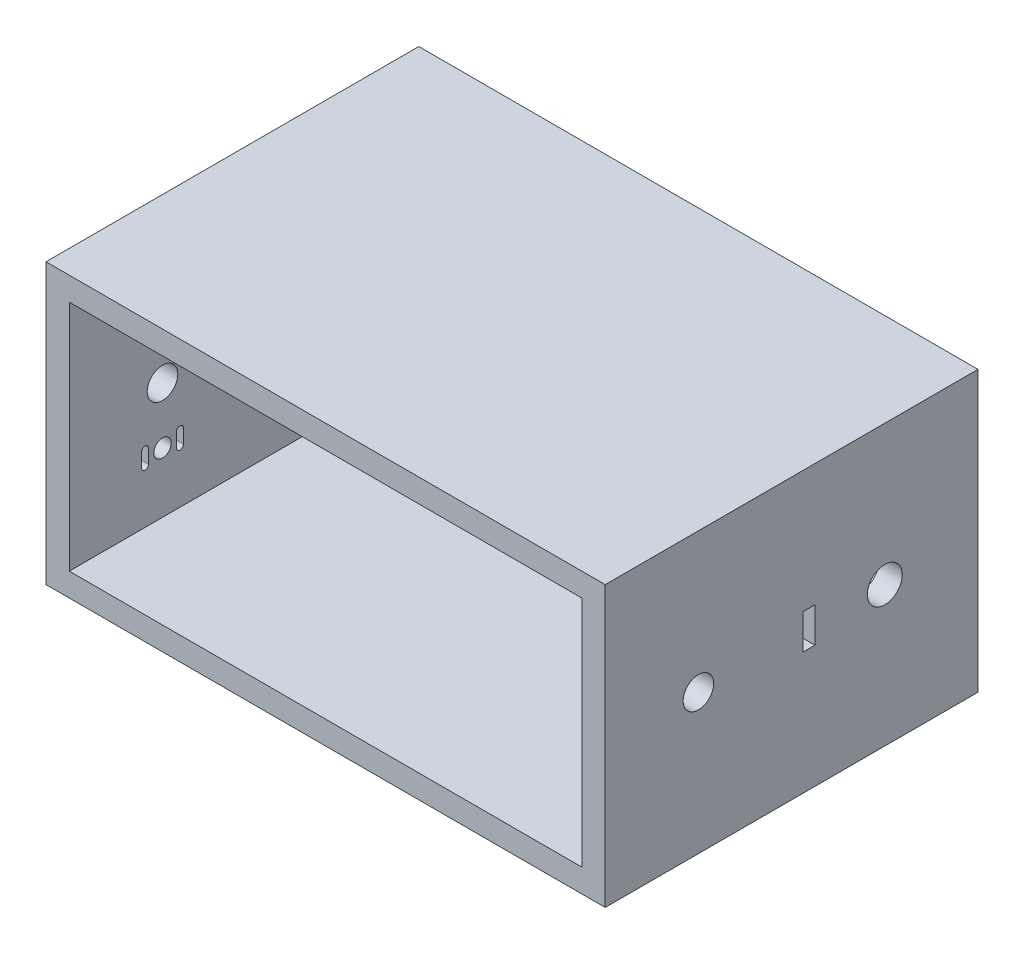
ISO-10303-21;
HEADER;
FILE_DESCRIPTION(('STEP AP214'),'2;1');
FILE_NAME('part.step','',(''),(''),'','','');
FILE_SCHEMA(('AUTOMOTIVE_DESIGN { 1 0 10303 214 1 1 1 1 }'));
ENDSEC;
DATA;
#1=APPLICATION_CONTEXT('core data for automotive mechanical design processes');
#2=APPLICATION_PROTOCOL_DEFINITION('international standard','automotive_design',2000,#1);
#3=PRODUCT_CONTEXT('',#1,'mechanical');
#4=PRODUCT('Part','Part','',(#3));
#5=PRODUCT_RELATED_PRODUCT_CATEGORY('part','',(#4));
#6=PRODUCT_DEFINITION_FORMATION('','',#4);
#7=PRODUCT_DEFINITION_CONTEXT('part definition',#1,'design');
#8=PRODUCT_DEFINITION('design','',#6,#7);
#9=PRODUCT_DEFINITION_SHAPE('','',#8);
#10=(LENGTH_UNIT() NAMED_UNIT(*) SI_UNIT(.MILLI.,.METRE.));
#11=(NAMED_UNIT(*) PLANE_ANGLE_UNIT() SI_UNIT($,.RADIAN.));
#12=(NAMED_UNIT(*) SI_UNIT($,.STERADIAN.) SOLID_ANGLE_UNIT());
#13=UNCERTAINTY_MEASURE_WITH_UNIT(LENGTH_MEASURE(1.E-05),#10,'distance_accuracy_value','');
#14=(GEOMETRIC_REPRESENTATION_CONTEXT(3) GLOBAL_UNCERTAINTY_ASSIGNED_CONTEXT((#13)) GLOBAL_UNIT_ASSIGNED_CONTEXT((#10,
#11,#12)) REPRESENTATION_CONTEXT('',''));
#15=CARTESIAN_POINT('',(0.,0.,0.));
#16=DIRECTION('',(0.,0.,1.));
#17=DIRECTION('',(1.,0.,0.));
#18=AXIS2_PLACEMENT_3D('',#15,#16,#17);
#19=CARTESIAN_POINT('',(-36.7081196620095,-26.4129533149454,203.2));
#20=DIRECTION('',(0.,0.,1.));
#21=DIRECTION('',(1.,0.,0.));
#22=AXIS2_PLACEMENT_3D('',#19,#20,#21);
#23=PLANE('',#22);
#24=DIRECTION('',(0.,-1.,0.));
#25=VECTOR('',#24,1.);
#26=CARTESIAN_POINT('',(-36.7081196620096,125.987046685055,203.2));
#27=LINE('',#26,#25);
#28=CARTESIAN_POINT('',(-36.7081196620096,125.987046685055,203.2));
#29=VERTEX_POINT('',#28);
#30=CARTESIAN_POINT('',(-36.7081196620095,-26.4129533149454,203.2));
#31=VERTEX_POINT('',#30);
#32=EDGE_CURVE('E362',#29,#31,#27,.T.);
#33=ORIENTED_EDGE('',*,*,#32,.T.);
#34=DIRECTION('',(1.,0.,0.));
#35=VECTOR('',#34,1.);
#36=CARTESIAN_POINT('',(-36.7081196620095,-26.4129533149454,203.2));
#37=LINE('',#36,#35);
#38=CARTESIAN_POINT('',(268.09188033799,-26.4129533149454,203.2));
#39=VERTEX_POINT('',#38);
#40=EDGE_CURVE('E365',#31,#39,#37,.T.);
#41=ORIENTED_EDGE('',*,*,#40,.T.);
#42=DIRECTION('',(0.,1.,0.));
#43=VECTOR('',#42,1.);
#44=CARTESIAN_POINT('',(268.09188033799,125.987046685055,203.2));
#45=LINE('',#44,#43);
#46=CARTESIAN_POINT('',(268.09188033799,125.987046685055,203.2));
#47=VERTEX_POINT('',#46);
#48=EDGE_CURVE('E368',#39,#47,#45,.T.);
#49=ORIENTED_EDGE('',*,*,#48,.T.);
#50=DIRECTION('',(-1.,0.,0.));
#51=VECTOR('',#50,1.);
#52=CARTESIAN_POINT('',(-36.7081196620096,125.987046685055,203.2));
#53=LINE('',#52,#51);
#54=EDGE_CURVE('E370',#47,#29,#53,.T.);
#55=ORIENTED_EDGE('',*,*,#54,.T.);
#56=EDGE_LOOP('',(#33,#41,#49,#55));
#57=FACE_BOUND('',#56,.T.);
#58=DIRECTION('',(1.,0.,0.));
#59=VECTOR('',#58,1.);
#60=CARTESIAN_POINT('',(-24.0081196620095,-13.7129533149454,203.2));
#61=LINE('',#60,#59);
#62=CARTESIAN_POINT('',(-24.0081196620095,-13.7129533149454,203.2));
#63=VERTEX_POINT('',#62);
#64=CARTESIAN_POINT('',(255.39188033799,-13.7129533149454,203.2));
#65=VERTEX_POINT('',#64);
#66=EDGE_CURVE('E333',#63,#65,#61,.T.);
#67=ORIENTED_EDGE('',*,*,#66,.F.);
#68=DIRECTION('',(0.,-1.,0.));
#69=VECTOR('',#68,1.);
#70=CARTESIAN_POINT('',(-24.0081196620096,113.287046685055,203.2));
#71=LINE('',#70,#69);
#72=CARTESIAN_POINT('',(-24.0081196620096,113.287046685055,203.2));
#73=VERTEX_POINT('',#72);
#74=EDGE_CURVE('E331',#73,#63,#71,.T.);
#75=ORIENTED_EDGE('',*,*,#74,.F.);
#76=DIRECTION('',(-1.,0.,0.));
#77=VECTOR('',#76,1.);
#78=CARTESIAN_POINT('',(-24.0081196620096,113.287046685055,203.2));
#79=LINE('',#78,#77);
#80=CARTESIAN_POINT('',(255.39188033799,113.287046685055,203.2));
#81=VERTEX_POINT('',#80);
#82=EDGE_CURVE('E339',#81,#73,#79,.T.);
#83=ORIENTED_EDGE('',*,*,#82,.F.);
#84=DIRECTION('',(0.,1.,0.));
#85=VECTOR('',#84,1.);
#86=CARTESIAN_POINT('',(255.39188033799,113.287046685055,203.2));
#87=LINE('',#86,#85);
#88=EDGE_CURVE('E336',#65,#81,#87,.T.);
#89=ORIENTED_EDGE('',*,*,#88,.F.);
#90=EDGE_LOOP('',(#67,#75,#83,#89));
#91=FACE_BOUND('',#90,.T.);
#92=ADVANCED_FACE('F30',(#57,#91),#23,.T.);
#93=CARTESIAN_POINT('',(-36.7081196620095,-26.4129533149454,0.));
#94=DIRECTION('',(0.,0.,1.));
#95=DIRECTION('',(1.,0.,0.));
#96=AXIS2_PLACEMENT_3D('',#93,#94,#95);
#97=PLANE('',#96);
#98=DIRECTION('',(0.,-1.,0.));
#99=VECTOR('',#98,1.);
#100=CARTESIAN_POINT('',(-36.7081196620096,125.987046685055,0.));
#101=LINE('',#100,#99);
#102=CARTESIAN_POINT('',(-36.7081196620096,125.987046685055,0.));
#103=VERTEX_POINT('',#102);
#104=CARTESIAN_POINT('',(-36.7081196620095,-26.4129533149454,0.));
#105=VERTEX_POINT('',#104);
#106=EDGE_CURVE('E361',#103,#105,#101,.T.);
#107=ORIENTED_EDGE('',*,*,#106,.F.);
#108=DIRECTION('',(-1.,0.,0.));
#109=VECTOR('',#108,1.);
#110=CARTESIAN_POINT('',(-36.7081196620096,125.987046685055,0.));
#111=LINE('',#110,#109);
#112=CARTESIAN_POINT('',(268.09188033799,125.987046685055,0.));
#113=VERTEX_POINT('',#112);
#114=EDGE_CURVE('E366',#113,#103,#111,.T.);
#115=ORIENTED_EDGE('',*,*,#114,.F.);
#116=DIRECTION('',(0.,1.,0.));
#117=VECTOR('',#116,1.);
#118=CARTESIAN_POINT('',(268.09188033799,125.987046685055,0.));
#119=LINE('',#118,#117);
#120=CARTESIAN_POINT('',(268.09188033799,-26.4129533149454,0.));
#121=VERTEX_POINT('',#120);
#122=EDGE_CURVE('E377',#121,#113,#119,.T.);
#123=ORIENTED_EDGE('',*,*,#122,.F.);
#124=DIRECTION('',(1.,0.,0.));
#125=VECTOR('',#124,1.);
#126=CARTESIAN_POINT('',(-36.7081196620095,-26.4129533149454,0.));
#127=LINE('',#126,#125);
#128=EDGE_CURVE('E375',#105,#121,#127,.T.);
#129=ORIENTED_EDGE('',*,*,#128,.F.);
#130=EDGE_LOOP('',(#107,#115,#123,#129));
#131=FACE_BOUND('',#130,.T.);
#132=DIRECTION('',(0.,-1.,0.));
#133=VECTOR('',#132,1.);
#134=CARTESIAN_POINT('',(-24.0081196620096,113.287046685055,0.));
#135=LINE('',#134,#133);
#136=CARTESIAN_POINT('',(-24.0081196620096,113.287046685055,0.));
#137=VERTEX_POINT('',#136);
#138=CARTESIAN_POINT('',(-24.0081196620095,-13.7129533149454,0.));
#139=VERTEX_POINT('',#138);
#140=EDGE_CURVE('E330',#137,#139,#135,.T.);
#141=ORIENTED_EDGE('',*,*,#140,.T.);
#142=DIRECTION('',(1.,0.,0.));
#143=VECTOR('',#142,1.);
#144=CARTESIAN_POINT('',(-24.0081196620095,-13.7129533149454,0.));
#145=LINE('',#144,#143);
#146=CARTESIAN_POINT('',(255.39188033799,-13.7129533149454,0.));
#147=VERTEX_POINT('',#146);
#148=EDGE_CURVE('E344',#139,#147,#145,.T.);
#149=ORIENTED_EDGE('',*,*,#148,.T.);
#150=DIRECTION('',(0.,1.,0.));
#151=VECTOR('',#150,1.);
#152=CARTESIAN_POINT('',(255.39188033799,113.287046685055,0.));
#153=LINE('',#152,#151);
#154=CARTESIAN_POINT('',(255.39188033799,113.287046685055,0.));
#155=VERTEX_POINT('',#154);
#156=EDGE_CURVE('E347',#147,#155,#153,.T.);
#157=ORIENTED_EDGE('',*,*,#156,.T.);
#158=DIRECTION('',(-1.,0.,0.));
#159=VECTOR('',#158,1.);
#160=CARTESIAN_POINT('',(-24.0081196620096,113.287046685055,0.));
#161=LINE('',#160,#159);
#162=EDGE_CURVE('E334',#155,#137,#161,.T.);
#163=ORIENTED_EDGE('',*,*,#162,.T.);
#164=EDGE_LOOP('',(#141,#149,#157,#163));
#165=FACE_BOUND('',#164,.T.);
#166=ADVANCED_FACE('F420',(#131,#165),#97,.F.);
#167=CARTESIAN_POINT('',(-36.7081196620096,125.987046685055,203.2));
#168=DIRECTION('',(1.,0.,0.));
#169=DIRECTION('',(0.,1.,0.));
#170=AXIS2_PLACEMENT_3D('',#167,#168,#169);
#171=PLANE('',#170);
#172=CARTESIAN_POINT('',(-36.7081196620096,49.7870466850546,50.8));
#173=DIRECTION('',(-1.,0.,0.));
#174=DIRECTION('',(0.,0.,1.));
#175=AXIS2_PLACEMENT_3D('',#172,#173,#174);
#176=CIRCLE('',#175,9.52499999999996);
#177=CARTESIAN_POINT('',(-36.7081196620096,49.7870466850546,60.325));
#178=VERTEX_POINT('',#177);
#179=EDGE_CURVE('E564',#178,#178,#176,.T.);
#180=ORIENTED_EDGE('',*,*,#179,.F.);
#181=EDGE_LOOP('',(#180));
#182=FACE_BOUND('',#181,.T.);
#183=DIRECTION('',(0.,0.,1.));
#184=VECTOR('',#183,1.);
#185=CARTESIAN_POINT('',(-36.7081196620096,40.2620466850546,88.9));
#186=LINE('',#185,#184);
#187=CARTESIAN_POINT('',(-36.7081196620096,40.2620466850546,88.9));
#188=VERTEX_POINT('',#187);
#189=CARTESIAN_POINT('',(-36.7081196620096,40.2620466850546,95.25));
#190=VERTEX_POINT('',#189);
#191=EDGE_CURVE('E228',#188,#190,#186,.T.);
#192=ORIENTED_EDGE('',*,*,#191,.F.);
#193=DIRECTION('',(0.,-1.,0.));
#194=VECTOR('',#193,1.);
#195=CARTESIAN_POINT('',(-36.7081196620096,40.2620466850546,88.9));
#196=LINE('',#195,#194);
#197=CARTESIAN_POINT('',(-36.7081196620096,59.3120466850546,88.9));
#198=VERTEX_POINT('',#197);
#199=EDGE_CURVE('E46',#198,#188,#196,.T.);
#200=ORIENTED_EDGE('',*,*,#199,.F.);
#201=DIRECTION('',(0.,0.,-1.));
#202=VECTOR('',#201,1.);
#203=CARTESIAN_POINT('',(-36.7081196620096,59.3120466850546,88.9));
#204=LINE('',#203,#202);
#205=CARTESIAN_POINT('',(-36.7081196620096,59.3120466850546,95.25));
#206=VERTEX_POINT('',#205);
#207=EDGE_CURVE('E216',#206,#198,#204,.T.);
#208=ORIENTED_EDGE('',*,*,#207,.F.);
#209=DIRECTION('',(0.,1.,0.));
#210=VECTOR('',#209,1.);
#211=CARTESIAN_POINT('',(-36.7081196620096,40.2620466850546,95.25));
#212=LINE('',#211,#210);
#213=EDGE_CURVE('E219',#190,#206,#212,.T.);
#214=ORIENTED_EDGE('',*,*,#213,.F.);
#215=EDGE_LOOP('',(#192,#200,#208,#214));
#216=FACE_BOUND('',#215,.T.);
#217=DIRECTION('',(0.,-1.,0.));
#218=VECTOR('',#217,1.);
#219=CARTESIAN_POINT('',(-36.7081196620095,22.86,160.02));
#220=LINE('',#219,#218);
#221=CARTESIAN_POINT('',(-36.7081196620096,22.86,160.02));
#222=VERTEX_POINT('',#221);
#223=CARTESIAN_POINT('',(-36.7081196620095,15.24,160.02));
#224=VERTEX_POINT('',#223);
#225=EDGE_CURVE('E263',#222,#224,#220,.T.);
#226=ORIENTED_EDGE('',*,*,#225,.F.);
#227=CARTESIAN_POINT('',(-36.7081196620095,22.86,161.925));
#228=DIRECTION('',(-1.,0.,0.));
#229=DIRECTION('',(0.,1.,0.));
#230=AXIS2_PLACEMENT_3D('',#227,#228,#229);
#231=CIRCLE('',#230,1.90499999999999);
#232=CARTESIAN_POINT('',(-36.7081196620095,22.86,163.83));
#233=VERTEX_POINT('',#232);
#234=EDGE_CURVE('E266',#233,#222,#231,.T.);
#235=ORIENTED_EDGE('',*,*,#234,.F.);
#236=DIRECTION('',(0.,1.,0.));
#237=VECTOR('',#236,1.);
#238=CARTESIAN_POINT('',(-36.7081196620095,22.86,163.83));
#239=LINE('',#238,#237);
#240=CARTESIAN_POINT('',(-36.7081196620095,15.24,163.83));
#241=VERTEX_POINT('',#240);
#242=EDGE_CURVE('E256',#241,#233,#239,.T.);
#243=ORIENTED_EDGE('',*,*,#242,.F.);
#244=CARTESIAN_POINT('',(-36.7081196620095,15.24,161.925));
#245=DIRECTION('',(-1.,0.,0.));
#246=DIRECTION('',(0.,1.,0.));
#247=AXIS2_PLACEMENT_3D('',#244,#245,#246);
#248=CIRCLE('',#247,1.90499999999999);
#249=EDGE_CURVE('E260',#224,#241,#248,.T.);
#250=ORIENTED_EDGE('',*,*,#249,.F.);
#251=EDGE_LOOP('',(#226,#235,#243,#250));
#252=FACE_BOUND('',#251,.T.);
#253=DIRECTION('',(0.,-1.,0.));
#254=VECTOR('',#253,1.);
#255=CARTESIAN_POINT('',(-36.7081196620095,22.86,140.97));
#256=LINE('',#255,#254);
#257=CARTESIAN_POINT('',(-36.7081196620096,22.86,140.97));
#258=VERTEX_POINT('',#257);
#259=CARTESIAN_POINT('',(-36.7081196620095,15.24,140.97));
#260=VERTEX_POINT('',#259);
#261=EDGE_CURVE('E295',#258,#260,#256,.T.);
#262=ORIENTED_EDGE('',*,*,#261,.F.);
#263=CARTESIAN_POINT('',(-36.7081196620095,22.86,142.875));
#264=DIRECTION('',(-1.,0.,0.));
#265=DIRECTION('',(0.,-1.,0.));
#266=AXIS2_PLACEMENT_3D('',#263,#264,#265);
#267=CIRCLE('',#266,1.90499999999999);
#268=CARTESIAN_POINT('',(-36.7081196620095,22.86,144.78));
#269=VERTEX_POINT('',#268);
#270=EDGE_CURVE('E298',#269,#258,#267,.T.);
#271=ORIENTED_EDGE('',*,*,#270,.F.);
#272=DIRECTION('',(0.,1.,0.));
#273=VECTOR('',#272,1.);
#274=CARTESIAN_POINT('',(-36.7081196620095,22.86,144.78));
#275=LINE('',#274,#273);
#276=CARTESIAN_POINT('',(-36.7081196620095,15.24,144.78));
#277=VERTEX_POINT('',#276);
#278=EDGE_CURVE('E288',#277,#269,#275,.T.);
#279=ORIENTED_EDGE('',*,*,#278,.F.);
#280=CARTESIAN_POINT('',(-36.7081196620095,15.24,142.875));
#281=DIRECTION('',(-1.,0.,0.));
#282=DIRECTION('',(0.,-1.,0.));
#283=AXIS2_PLACEMENT_3D('',#280,#281,#282);
#284=CIRCLE('',#283,1.90499999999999);
#285=EDGE_CURVE('E292',#260,#277,#284,.T.);
#286=ORIENTED_EDGE('',*,*,#285,.F.);
#287=EDGE_LOOP('',(#262,#271,#279,#286));
#288=FACE_BOUND('',#287,.T.);
#289=CARTESIAN_POINT('',(-36.7081196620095,19.05,152.4));
#290=DIRECTION('',(-1.,0.,0.));
#291=DIRECTION('',(0.,-1.,0.));
#292=AXIS2_PLACEMENT_3D('',#289,#290,#291);
#293=CIRCLE('',#292,4.76250000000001);
#294=CARTESIAN_POINT('',(-36.7081196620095,14.2875,152.4));
#295=VERTEX_POINT('',#294);
#296=EDGE_CURVE('E317',#295,#295,#293,.T.);
#297=ORIENTED_EDGE('',*,*,#296,.F.);
#298=EDGE_LOOP('',(#297));
#299=FACE_BOUND('',#298,.T.);
#300=CARTESIAN_POINT('',(-36.7081196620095,49.7870466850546,152.4));
#301=DIRECTION('',(1.,0.,0.));
#302=DIRECTION('',(0.,0.,-1.));
#303=AXIS2_PLACEMENT_3D('',#300,#301,#302);
#304=CIRCLE('',#303,8.33373999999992);
#305=CARTESIAN_POINT('',(-36.7081196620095,49.7870466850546,144.06626));
#306=VERTEX_POINT('',#305);
#307=EDGE_CURVE('E323',#306,#306,#304,.T.);
#308=ORIENTED_EDGE('',*,*,#307,.T.);
#309=EDGE_LOOP('',(#308));
#310=FACE_BOUND('',#309,.T.);
#311=ORIENTED_EDGE('',*,*,#106,.T.);
#312=DIRECTION('',(0.,0.,-1.));
#313=VECTOR('',#312,1.);
#314=CARTESIAN_POINT('',(-36.7081196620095,-26.4129533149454,203.2));
#315=LINE('',#314,#313);
#316=EDGE_CURVE('E388',#31,#105,#315,.T.);
#317=ORIENTED_EDGE('',*,*,#316,.F.);
#318=ORIENTED_EDGE('',*,*,#32,.F.);
#319=DIRECTION('',(0.,0.,-1.));
#320=VECTOR('',#319,1.);
#321=CARTESIAN_POINT('',(-36.7081196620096,125.987046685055,203.2));
#322=LINE('',#321,#320);
#323=EDGE_CURVE('E372',#29,#103,#322,.T.);
#324=ORIENTED_EDGE('',*,*,#323,.T.);
#325=EDGE_LOOP('',(#311,#317,#318,#324));
#326=FACE_BOUND('',#325,.T.);
#327=ADVANCED_FACE('F32',(#182,#216,#252,#288,#299,#310,#326),#171,.F.);
#328=CARTESIAN_POINT('',(-36.7081196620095,-26.4129533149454,203.2));
#329=DIRECTION('',(0.,1.,0.));
#330=DIRECTION('',(-1.,0.,0.));
#331=AXIS2_PLACEMENT_3D('',#328,#329,#330);
#332=PLANE('',#331);
#333=ORIENTED_EDGE('',*,*,#128,.T.);
#334=DIRECTION('',(0.,0.,-1.));
#335=VECTOR('',#334,1.);
#336=CARTESIAN_POINT('',(268.09188033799,-26.4129533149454,203.2));
#337=LINE('',#336,#335);
#338=EDGE_CURVE('E385',#39,#121,#337,.T.);
#339=ORIENTED_EDGE('',*,*,#338,.F.);
#340=ORIENTED_EDGE('',*,*,#40,.F.);
#341=ORIENTED_EDGE('',*,*,#316,.T.);
#342=EDGE_LOOP('',(#333,#339,#340,#341));
#343=FACE_BOUND('',#342,.T.);
#344=ADVANCED_FACE('F438',(#343),#332,.F.);
#345=CARTESIAN_POINT('',(268.09188033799,125.987046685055,203.2));
#346=DIRECTION('',(-1.,0.,0.));
#347=DIRECTION('',(0.,0.,1.));
#348=AXIS2_PLACEMENT_3D('',#345,#346,#347);
#349=PLANE('',#348);
#350=CARTESIAN_POINT('',(268.09188033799,49.7870466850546,50.8));
#351=DIRECTION('',(-1.,0.,0.));
#352=DIRECTION('',(0.,0.,1.));
#353=AXIS2_PLACEMENT_3D('',#350,#351,#352);
#354=CIRCLE('',#353,9.52499999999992);
#355=CARTESIAN_POINT('',(268.09188033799,49.7870466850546,60.3249999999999));
#356=VERTEX_POINT('',#355);
#357=EDGE_CURVE('E563',#356,#356,#354,.T.);
#358=ORIENTED_EDGE('',*,*,#357,.T.);
#359=EDGE_LOOP('',(#358));
#360=FACE_BOUND('',#359,.T.);
#361=DIRECTION('',(0.,0.,-1.));
#362=VECTOR('',#361,1.);
#363=CARTESIAN_POINT('',(268.09188033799,59.3120466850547,88.9));
#364=LINE('',#363,#362);
#365=CARTESIAN_POINT('',(268.09188033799,59.3120466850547,95.25));
#366=VERTEX_POINT('',#365);
#367=CARTESIAN_POINT('',(268.09188033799,59.3120466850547,88.9));
#368=VERTEX_POINT('',#367);
#369=EDGE_CURVE('E215',#366,#368,#364,.T.);
#370=ORIENTED_EDGE('',*,*,#369,.T.);
#371=DIRECTION('',(0.,-1.,0.));
#372=VECTOR('',#371,1.);
#373=CARTESIAN_POINT('',(268.09188033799,40.2620466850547,88.9));
#374=LINE('',#373,#372);
#375=CARTESIAN_POINT('',(268.09188033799,40.2620466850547,88.9));
#376=VERTEX_POINT('',#375);
#377=EDGE_CURVE('E198',#368,#376,#374,.T.);
#378=ORIENTED_EDGE('',*,*,#377,.T.);
#379=DIRECTION('',(0.,0.,1.));
#380=VECTOR('',#379,1.);
#381=CARTESIAN_POINT('',(268.09188033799,40.2620466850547,88.9));
#382=LINE('',#381,#380);
#383=CARTESIAN_POINT('',(268.09188033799,40.2620466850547,95.25));
#384=VERTEX_POINT('',#383);
#385=EDGE_CURVE('E207',#376,#384,#382,.T.);
#386=ORIENTED_EDGE('',*,*,#385,.T.);
#387=DIRECTION('',(0.,1.,0.));
#388=VECTOR('',#387,1.);
#389=CARTESIAN_POINT('',(268.09188033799,40.2620466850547,95.25));
#390=LINE('',#389,#388);
#391=EDGE_CURVE('E54',#384,#366,#390,.T.);
#392=ORIENTED_EDGE('',*,*,#391,.T.);
#393=EDGE_LOOP('',(#370,#378,#386,#392));
#394=FACE_BOUND('',#393,.T.);
#395=CARTESIAN_POINT('',(268.09188033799,49.7870466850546,152.4));
#396=DIRECTION('',(1.,0.,0.));
#397=DIRECTION('',(0.,0.,-1.));
#398=AXIS2_PLACEMENT_3D('',#395,#396,#397);
#399=CIRCLE('',#398,8.33373999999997);
#400=CARTESIAN_POINT('',(268.09188033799,49.7870466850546,144.06626));
#401=VERTEX_POINT('',#400);
#402=EDGE_CURVE('E320',#401,#401,#399,.T.);
#403=ORIENTED_EDGE('',*,*,#402,.F.);
#404=EDGE_LOOP('',(#403));
#405=FACE_BOUND('',#404,.T.);
#406=ORIENTED_EDGE('',*,*,#122,.T.);
#407=DIRECTION('',(0.,0.,-1.));
#408=VECTOR('',#407,1.);
#409=CARTESIAN_POINT('',(268.09188033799,125.987046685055,203.2));
#410=LINE('',#409,#408);
#411=EDGE_CURVE('E382',#47,#113,#410,.T.);
#412=ORIENTED_EDGE('',*,*,#411,.F.);
#413=ORIENTED_EDGE('',*,*,#48,.F.);
#414=ORIENTED_EDGE('',*,*,#338,.T.);
#415=EDGE_LOOP('',(#406,#412,#413,#414));
#416=FACE_BOUND('',#415,.T.);
#417=ADVANCED_FACE('F212',(#360,#394,#405,#416),#349,.F.);
#418=CARTESIAN_POINT('',(-36.7081196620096,125.987046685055,203.2));
#419=DIRECTION('',(0.,-1.,0.));
#420=DIRECTION('',(0.,0.,-1.));
#421=AXIS2_PLACEMENT_3D('',#418,#419,#420);
#422=PLANE('',#421);
#423=ORIENTED_EDGE('',*,*,#114,.T.);
#424=ORIENTED_EDGE('',*,*,#323,.F.);
#425=ORIENTED_EDGE('',*,*,#54,.F.);
#426=ORIENTED_EDGE('',*,*,#411,.T.);
#427=EDGE_LOOP('',(#423,#424,#425,#426));
#428=FACE_BOUND('',#427,.T.);
#429=ADVANCED_FACE('F433',(#428),#422,.F.);
#430=CARTESIAN_POINT('',(-24.0081196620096,113.287046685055,203.2));
#431=DIRECTION('',(1.,0.,0.));
#432=DIRECTION('',(0.,1.,0.));
#433=AXIS2_PLACEMENT_3D('',#430,#431,#432);
#434=PLANE('',#433);
#435=CARTESIAN_POINT('',(-24.0081196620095,49.7870466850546,50.8));
#436=DIRECTION('',(1.,0.,0.));
#437=DIRECTION('',(0.,1.,0.));
#438=AXIS2_PLACEMENT_3D('',#435,#436,#437);
#439=CIRCLE('',#438,9.52499999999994);
#440=CARTESIAN_POINT('',(-24.0081196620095,59.3120466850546,50.8));
#441=VERTEX_POINT('',#440);
#442=EDGE_CURVE('E222',#441,#441,#439,.T.);
#443=ORIENTED_EDGE('',*,*,#442,.F.);
#444=EDGE_LOOP('',(#443));
#445=FACE_BOUND('',#444,.T.);
#446=DIRECTION('',(0.,1.,0.));
#447=VECTOR('',#446,1.);
#448=CARTESIAN_POINT('',(-24.0081196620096,113.287046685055,88.9));
#449=LINE('',#448,#447);
#450=CARTESIAN_POINT('',(-24.0081196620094,40.2620466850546,88.9));
#451=VERTEX_POINT('',#450);
#452=CARTESIAN_POINT('',(-24.0081196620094,59.3120466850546,88.9));
#453=VERTEX_POINT('',#452);
#454=EDGE_CURVE('E248',#451,#453,#449,.T.);
#455=ORIENTED_EDGE('',*,*,#454,.F.);
#456=DIRECTION('',(0.,0.,-1.));
#457=VECTOR('',#456,1.);
#458=CARTESIAN_POINT('',(-24.0081196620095,40.2620466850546,203.2));
#459=LINE('',#458,#457);
#460=CARTESIAN_POINT('',(-24.0081196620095,40.2620466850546,95.25));
#461=VERTEX_POINT('',#460);
#462=EDGE_CURVE('E235',#461,#451,#459,.T.);
#463=ORIENTED_EDGE('',*,*,#462,.F.);
#464=DIRECTION('',(0.,-1.,0.));
#465=VECTOR('',#464,1.);
#466=CARTESIAN_POINT('',(-24.0081196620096,113.287046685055,95.25));
#467=LINE('',#466,#465);
#468=CARTESIAN_POINT('',(-24.0081196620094,59.3120466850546,95.25));
#469=VERTEX_POINT('',#468);
#470=EDGE_CURVE('E243',#469,#461,#467,.T.);
#471=ORIENTED_EDGE('',*,*,#470,.F.);
#472=DIRECTION('',(0.,0.,1.));
#473=VECTOR('',#472,1.);
#474=CARTESIAN_POINT('',(-24.0081196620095,59.3120466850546,203.2));
#475=LINE('',#474,#473);
#476=EDGE_CURVE('E246',#453,#469,#475,.T.);
#477=ORIENTED_EDGE('',*,*,#476,.F.);
#478=EDGE_LOOP('',(#455,#463,#471,#477));
#479=FACE_BOUND('',#478,.T.);
#480=CARTESIAN_POINT('',(-24.0081196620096,22.86,161.925));
#481=DIRECTION('',(1.,0.,0.));
#482=DIRECTION('',(0.,1.,0.));
#483=AXIS2_PLACEMENT_3D('',#480,#481,#482);
#484=CIRCLE('',#483,1.90499999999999);
#485=CARTESIAN_POINT('',(-24.0081196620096,22.86,163.83));
#486=VERTEX_POINT('',#485);
#487=CARTESIAN_POINT('',(-24.0081196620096,22.86,160.02));
#488=VERTEX_POINT('',#487);
#489=EDGE_CURVE('E250',#486,#488,#484,.F.);
#490=ORIENTED_EDGE('',*,*,#489,.T.);
#491=DIRECTION('',(0.,-1.,0.));
#492=VECTOR('',#491,1.);
#493=CARTESIAN_POINT('',(-24.0081196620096,22.86,160.02));
#494=LINE('',#493,#492);
#495=CARTESIAN_POINT('',(-24.0081196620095,15.24,160.02));
#496=VERTEX_POINT('',#495);
#497=EDGE_CURVE('E251',#488,#496,#494,.T.);
#498=ORIENTED_EDGE('',*,*,#497,.T.);
#499=CARTESIAN_POINT('',(-24.0081196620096,15.24,161.925));
#500=DIRECTION('',(1.,0.,0.));
#501=DIRECTION('',(0.,1.,0.));
#502=AXIS2_PLACEMENT_3D('',#499,#500,#501);
#503=CIRCLE('',#502,1.90499999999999);
#504=CARTESIAN_POINT('',(-24.0081196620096,15.24,163.83));
#505=VERTEX_POINT('',#504);
#506=EDGE_CURVE('E275',#496,#505,#503,.F.);
#507=ORIENTED_EDGE('',*,*,#506,.T.);
#508=DIRECTION('',(0.,1.,0.));
#509=VECTOR('',#508,1.);
#510=CARTESIAN_POINT('',(-24.0081196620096,22.86,163.83));
#511=LINE('',#510,#509);
#512=EDGE_CURVE('E271',#505,#486,#511,.T.);
#513=ORIENTED_EDGE('',*,*,#512,.T.);
#514=EDGE_LOOP('',(#490,#498,#507,#513));
#515=FACE_BOUND('',#514,.T.);
#516=CARTESIAN_POINT('',(-24.0081196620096,22.86,142.875));
#517=DIRECTION('',(1.,0.,0.));
#518=DIRECTION('',(0.,1.,0.));
#519=AXIS2_PLACEMENT_3D('',#516,#517,#518);
#520=CIRCLE('',#519,1.90499999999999);
#521=CARTESIAN_POINT('',(-24.0081196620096,22.86,144.78));
#522=VERTEX_POINT('',#521);
#523=CARTESIAN_POINT('',(-24.0081196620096,22.86,140.97));
#524=VERTEX_POINT('',#523);
#525=EDGE_CURVE('E259',#522,#524,#520,.F.);
#526=ORIENTED_EDGE('',*,*,#525,.T.);
#527=DIRECTION('',(0.,-1.,0.));
#528=VECTOR('',#527,1.);
#529=CARTESIAN_POINT('',(-24.0081196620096,22.86,140.97));
#530=LINE('',#529,#528);
#531=CARTESIAN_POINT('',(-24.0081196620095,15.24,140.97));
#532=VERTEX_POINT('',#531);
#533=EDGE_CURVE('E283',#524,#532,#530,.T.);
#534=ORIENTED_EDGE('',*,*,#533,.T.);
#535=CARTESIAN_POINT('',(-24.0081196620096,15.24,142.875));
#536=DIRECTION('',(1.,0.,0.));
#537=DIRECTION('',(0.,1.,0.));
#538=AXIS2_PLACEMENT_3D('',#535,#536,#537);
#539=CIRCLE('',#538,1.90499999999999);
#540=CARTESIAN_POINT('',(-24.0081196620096,15.24,144.78));
#541=VERTEX_POINT('',#540);
#542=EDGE_CURVE('E307',#532,#541,#539,.F.);
#543=ORIENTED_EDGE('',*,*,#542,.T.);
#544=DIRECTION('',(0.,1.,0.));
#545=VECTOR('',#544,1.);
#546=CARTESIAN_POINT('',(-24.0081196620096,22.86,144.78));
#547=LINE('',#546,#545);
#548=EDGE_CURVE('E303',#541,#522,#547,.T.);
#549=ORIENTED_EDGE('',*,*,#548,.T.);
#550=EDGE_LOOP('',(#526,#534,#543,#549));
#551=FACE_BOUND('',#550,.T.);
#552=CARTESIAN_POINT('',(-24.0081196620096,19.05,152.4));
#553=DIRECTION('',(1.,0.,0.));
#554=DIRECTION('',(0.,1.,0.));
#555=AXIS2_PLACEMENT_3D('',#552,#553,#554);
#556=CIRCLE('',#555,4.76250000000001);
#557=CARTESIAN_POINT('',(-24.0081196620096,14.2875,152.4));
#558=VERTEX_POINT('',#557);
#559=EDGE_CURVE('E291',#558,#558,#556,.F.);
#560=ORIENTED_EDGE('',*,*,#559,.T.);
#561=EDGE_LOOP('',(#560));
#562=FACE_BOUND('',#561,.T.);
#563=CARTESIAN_POINT('',(-24.0081196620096,49.7870466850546,152.4));
#564=DIRECTION('',(1.,0.,0.));
#565=DIRECTION('',(0.,1.,0.));
#566=AXIS2_PLACEMENT_3D('',#563,#564,#565);
#567=CIRCLE('',#566,8.33373999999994);
#568=CARTESIAN_POINT('',(-24.0081196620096,58.1207866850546,152.4));
#569=VERTEX_POINT('',#568);
#570=EDGE_CURVE('E327',#569,#569,#567,.T.);
#571=ORIENTED_EDGE('',*,*,#570,.F.);
#572=EDGE_LOOP('',(#571));
#573=FACE_BOUND('',#572,.T.);
#574=ORIENTED_EDGE('',*,*,#140,.F.);
#575=DIRECTION('',(0.,0.,-1.));
#576=VECTOR('',#575,1.);
#577=CARTESIAN_POINT('',(-24.0081196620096,113.287046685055,203.2));
#578=LINE('',#577,#576);
#579=EDGE_CURVE('E341',#73,#137,#578,.T.);
#580=ORIENTED_EDGE('',*,*,#579,.F.);
#581=ORIENTED_EDGE('',*,*,#74,.T.);
#582=DIRECTION('',(0.,0.,-1.));
#583=VECTOR('',#582,1.);
#584=CARTESIAN_POINT('',(-24.0081196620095,-13.7129533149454,203.2));
#585=LINE('',#584,#583);
#586=EDGE_CURVE('E358',#63,#139,#585,.T.);
#587=ORIENTED_EDGE('',*,*,#586,.T.);
#588=EDGE_LOOP('',(#574,#580,#581,#587));
#589=FACE_BOUND('',#588,.T.);
#590=ADVANCED_FACE('F430',(#445,#479,#515,#551,#562,#573,#589),#434,.T.);
#591=CARTESIAN_POINT('',(-24.0081196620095,-13.7129533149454,203.2));
#592=DIRECTION('',(0.,1.,0.));
#593=DIRECTION('',(0.,0.,1.));
#594=AXIS2_PLACEMENT_3D('',#591,#592,#593);
#595=PLANE('',#594);
#596=ORIENTED_EDGE('',*,*,#148,.F.);
#597=ORIENTED_EDGE('',*,*,#586,.F.);
#598=ORIENTED_EDGE('',*,*,#66,.T.);
#599=DIRECTION('',(0.,0.,-1.));
#600=VECTOR('',#599,1.);
#601=CARTESIAN_POINT('',(255.39188033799,-13.7129533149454,203.2));
#602=LINE('',#601,#600);
#603=EDGE_CURVE('E356',#65,#147,#602,.T.);
#604=ORIENTED_EDGE('',*,*,#603,.T.);
#605=EDGE_LOOP('',(#596,#597,#598,#604));
#606=FACE_BOUND('',#605,.T.);
#607=ADVANCED_FACE('F470',(#606),#595,.T.);
#608=CARTESIAN_POINT('',(255.39188033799,113.287046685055,203.2));
#609=DIRECTION('',(-1.,0.,0.));
#610=DIRECTION('',(0.,0.,1.));
#611=AXIS2_PLACEMENT_3D('',#608,#609,#610);
#612=PLANE('',#611);
#613=CARTESIAN_POINT('',(255.39188033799,49.7870466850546,50.8));
#614=DIRECTION('',(-1.,0.,0.));
#615=DIRECTION('',(0.,0.,1.));
#616=AXIS2_PLACEMENT_3D('',#613,#614,#615);
#617=CIRCLE('',#616,9.52499999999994);
#618=CARTESIAN_POINT('',(255.39188033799,49.7870466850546,60.325));
#619=VERTEX_POINT('',#618);
#620=EDGE_CURVE('E34',#619,#619,#617,.T.);
#621=ORIENTED_EDGE('',*,*,#620,.F.);
#622=EDGE_LOOP('',(#621));
#623=FACE_BOUND('',#622,.T.);
#624=DIRECTION('',(0.,-1.,0.));
#625=VECTOR('',#624,1.);
#626=CARTESIAN_POINT('',(255.39188033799,113.287046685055,88.9));
#627=LINE('',#626,#625);
#628=CARTESIAN_POINT('',(255.39188033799,59.3120466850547,88.9));
#629=VERTEX_POINT('',#628);
#630=CARTESIAN_POINT('',(255.39188033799,40.2620466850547,88.9));
#631=VERTEX_POINT('',#630);
#632=EDGE_CURVE('E11',#629,#631,#627,.T.);
#633=ORIENTED_EDGE('',*,*,#632,.F.);
#634=DIRECTION('',(0.,0.,-1.));
#635=VECTOR('',#634,1.);
#636=CARTESIAN_POINT('',(255.39188033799,59.3120466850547,203.2));
#637=LINE('',#636,#635);
#638=CARTESIAN_POINT('',(255.39188033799,59.3120466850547,95.25));
#639=VERTEX_POINT('',#638);
#640=EDGE_CURVE('E39',#639,#629,#637,.T.);
#641=ORIENTED_EDGE('',*,*,#640,.F.);
#642=DIRECTION('',(0.,1.,0.));
#643=VECTOR('',#642,1.);
#644=CARTESIAN_POINT('',(255.39188033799,113.287046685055,95.25));
#645=LINE('',#644,#643);
#646=CARTESIAN_POINT('',(255.39188033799,40.2620466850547,95.25));
#647=VERTEX_POINT('',#646);
#648=EDGE_CURVE('E395',#647,#639,#645,.T.);
#649=ORIENTED_EDGE('',*,*,#648,.F.);
#650=DIRECTION('',(0.,0.,1.));
#651=VECTOR('',#650,1.);
#652=CARTESIAN_POINT('',(255.39188033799,40.2620466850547,203.2));
#653=LINE('',#652,#651);
#654=EDGE_CURVE('E391',#631,#647,#653,.T.);
#655=ORIENTED_EDGE('',*,*,#654,.F.);
#656=EDGE_LOOP('',(#633,#641,#649,#655));
#657=FACE_BOUND('',#656,.T.);
#658=CARTESIAN_POINT('',(255.39188033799,49.7870466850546,152.4));
#659=DIRECTION('',(-1.,0.,0.));
#660=DIRECTION('',(0.,0.,1.));
#661=AXIS2_PLACEMENT_3D('',#658,#659,#660);
#662=CIRCLE('',#661,8.33373999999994);
#663=CARTESIAN_POINT('',(255.39188033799,49.7870466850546,160.73374));
#664=VERTEX_POINT('',#663);
#665=EDGE_CURVE('E326',#664,#664,#662,.T.);
#666=ORIENTED_EDGE('',*,*,#665,.F.);
#667=EDGE_LOOP('',(#666));
#668=FACE_BOUND('',#667,.T.);
#669=ORIENTED_EDGE('',*,*,#156,.F.);
#670=ORIENTED_EDGE('',*,*,#603,.F.);
#671=ORIENTED_EDGE('',*,*,#88,.T.);
#672=DIRECTION('',(0.,0.,-1.));
#673=VECTOR('',#672,1.);
#674=CARTESIAN_POINT('',(255.39188033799,113.287046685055,203.2));
#675=LINE('',#674,#673);
#676=EDGE_CURVE('E354',#81,#155,#675,.T.);
#677=ORIENTED_EDGE('',*,*,#676,.T.);
#678=EDGE_LOOP('',(#669,#670,#671,#677));
#679=FACE_BOUND('',#678,.T.);
#680=ADVANCED_FACE('F402',(#623,#657,#668,#679),#612,.T.);
#681=CARTESIAN_POINT('',(-24.0081196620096,113.287046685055,203.2));
#682=DIRECTION('',(0.,-1.,0.));
#683=DIRECTION('',(0.,0.,-1.));
#684=AXIS2_PLACEMENT_3D('',#681,#682,#683);
#685=PLANE('',#684);
#686=ORIENTED_EDGE('',*,*,#162,.F.);
#687=ORIENTED_EDGE('',*,*,#676,.F.);
#688=ORIENTED_EDGE('',*,*,#82,.T.);
#689=ORIENTED_EDGE('',*,*,#579,.T.);
#690=EDGE_LOOP('',(#686,#687,#688,#689));
#691=FACE_BOUND('',#690,.T.);
#692=ADVANCED_FACE('F465',(#691),#685,.T.);
#693=CARTESIAN_POINT('',(268.09188033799,49.7870466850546,152.4));
#694=DIRECTION('',(1.,0.,0.));
#695=DIRECTION('',(0.,0.,-1.));
#696=AXIS2_PLACEMENT_3D('',#693,#694,#695);
#697=CYLINDRICAL_SURFACE('',#696,8.33373999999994);
#698=ORIENTED_EDGE('',*,*,#665,.T.);
#699=EDGE_LOOP('',(#698));
#700=FACE_BOUND('',#699,.T.);
#701=ORIENTED_EDGE('',*,*,#402,.T.);
#702=EDGE_LOOP('',(#701));
#703=FACE_BOUND('',#702,.T.);
#704=ADVANCED_FACE('F481',(#700,#703),#697,.F.);
#705=ORIENTED_EDGE('',*,*,#570,.T.);
#706=EDGE_LOOP('',(#705));
#707=FACE_BOUND('',#706,.T.);
#708=ORIENTED_EDGE('',*,*,#307,.F.);
#709=EDGE_LOOP('',(#708));
#710=FACE_BOUND('',#709,.T.);
#711=ADVANCED_FACE('F487',(#707,#710),#697,.F.);
#712=CARTESIAN_POINT('',(268.09288033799,19.05,152.4));
#713=DIRECTION('',(-1.,0.,0.));
#714=DIRECTION('',(0.,-1.,0.));
#715=AXIS2_PLACEMENT_3D('',#712,#713,#714);
#716=CYLINDRICAL_SURFACE('',#715,4.76250000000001);
#717=CARTESIAN_POINT('',(-24.0081196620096,14.2875,152.4));
#718=CARTESIAN_POINT('',(-24.1404113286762,14.2875,152.4));
#719=CARTESIAN_POINT('',(-24.2727029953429,14.2875,152.4));
#720=CARTESIAN_POINT('',(-24.5372863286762,14.2875,152.4));
#721=CARTESIAN_POINT('',(-24.6695779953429,14.2875,152.4));
#722=CARTESIAN_POINT('',(-24.9341613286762,14.2875,152.4));
#723=CARTESIAN_POINT('',(-25.0664529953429,14.2875,152.4));
#724=CARTESIAN_POINT('',(-25.3310363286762,14.2875,152.4));
#725=CARTESIAN_POINT('',(-25.4633279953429,14.2875,152.4));
#726=CARTESIAN_POINT('',(-25.7279113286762,14.2875,152.4));
#727=CARTESIAN_POINT('',(-25.8602029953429,14.2875,152.4));
#728=CARTESIAN_POINT('',(-26.1247863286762,14.2875,152.4));
#729=CARTESIAN_POINT('',(-26.2570779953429,14.2875,152.4));
#730=CARTESIAN_POINT('',(-26.5216613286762,14.2875,152.4));
#731=CARTESIAN_POINT('',(-26.6539529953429,14.2875,152.4));
#732=CARTESIAN_POINT('',(-26.9185363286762,14.2875,152.4));
#733=CARTESIAN_POINT('',(-27.0508279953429,14.2875,152.4));
#734=CARTESIAN_POINT('',(-27.3154113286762,14.2875,152.4));
#735=CARTESIAN_POINT('',(-27.4477029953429,14.2875,152.4));
#736=CARTESIAN_POINT('',(-27.7122863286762,14.2875,152.4));
#737=CARTESIAN_POINT('',(-27.8445779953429,14.2875,152.4));
#738=CARTESIAN_POINT('',(-28.1091613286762,14.2875,152.4));
#739=CARTESIAN_POINT('',(-28.2414529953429,14.2875,152.4));
#740=CARTESIAN_POINT('',(-28.5060363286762,14.2875,152.4));
#741=CARTESIAN_POINT('',(-28.6383279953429,14.2875,152.4));
#742=CARTESIAN_POINT('',(-28.9029113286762,14.2875,152.4));
#743=CARTESIAN_POINT('',(-29.0352029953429,14.2875,152.4));
#744=CARTESIAN_POINT('',(-29.2997863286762,14.2875,152.4));
#745=CARTESIAN_POINT('',(-29.4320779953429,14.2875,152.4));
#746=CARTESIAN_POINT('',(-29.6966613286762,14.2875,152.4));
#747=CARTESIAN_POINT('',(-29.8289529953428,14.2875,152.4));
#748=CARTESIAN_POINT('',(-30.0935363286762,14.2875,152.4));
#749=CARTESIAN_POINT('',(-30.2258279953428,14.2875,152.4));
#750=CARTESIAN_POINT('',(-30.4904113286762,14.2875,152.4));
#751=CARTESIAN_POINT('',(-30.6227029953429,14.2875,152.4));
#752=CARTESIAN_POINT('',(-30.8872863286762,14.2875,152.4));
#753=CARTESIAN_POINT('',(-31.0195779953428,14.2875,152.4));
#754=CARTESIAN_POINT('',(-31.2841613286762,14.2875,152.4));
#755=CARTESIAN_POINT('',(-31.4164529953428,14.2875,152.4));
#756=CARTESIAN_POINT('',(-31.6810363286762,14.2875,152.4));
#757=CARTESIAN_POINT('',(-31.8133279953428,14.2875,152.4));
#758=CARTESIAN_POINT('',(-32.0779113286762,14.2875,152.4));
#759=CARTESIAN_POINT('',(-32.2102029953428,14.2875,152.4));
#760=CARTESIAN_POINT('',(-32.4747863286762,14.2875,152.4));
#761=CARTESIAN_POINT('',(-32.6070779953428,14.2875,152.4));
#762=CARTESIAN_POINT('',(-32.8716613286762,14.2875,152.4));
#763=CARTESIAN_POINT('',(-33.0039529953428,14.2875,152.4));
#764=CARTESIAN_POINT('',(-33.2685363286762,14.2875,152.4));
#765=CARTESIAN_POINT('',(-33.4008279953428,14.2875,152.4));
#766=CARTESIAN_POINT('',(-33.6654113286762,14.2875,152.4));
#767=CARTESIAN_POINT('',(-33.7977029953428,14.2875,152.4));
#768=CARTESIAN_POINT('',(-34.0622863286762,14.2875,152.4));
#769=CARTESIAN_POINT('',(-34.1945779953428,14.2875,152.4));
#770=CARTESIAN_POINT('',(-34.4591613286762,14.2875,152.4));
#771=CARTESIAN_POINT('',(-34.5914529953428,14.2875,152.4));
#772=CARTESIAN_POINT('',(-34.8560363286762,14.2875,152.4));
#773=CARTESIAN_POINT('',(-34.9883279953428,14.2875,152.4));
#774=CARTESIAN_POINT('',(-35.2529113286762,14.2875,152.4));
#775=CARTESIAN_POINT('',(-35.3852029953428,14.2875,152.4));
#776=CARTESIAN_POINT('',(-35.6497863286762,14.2875,152.4));
#777=CARTESIAN_POINT('',(-35.7820779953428,14.2875,152.4));
#778=CARTESIAN_POINT('',(-36.0466613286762,14.2875,152.4));
#779=CARTESIAN_POINT('',(-36.1789529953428,14.2875,152.4));
#780=CARTESIAN_POINT('',(-36.4435363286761,14.2875,152.4));
#781=CARTESIAN_POINT('',(-36.5758279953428,14.2875,152.4));
#782=CARTESIAN_POINT('',(-36.7081196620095,14.2875,152.4));
#783=B_SPLINE_CURVE_WITH_KNOTS('',3,(#717,#718,#719,#720,#721,#722,#723,#724,#725,#726,#727,
#728,#729,#730,#731,#732,#733,#734,#735,#736,#737,#738,#739,#740,#741,#742,#743,#744,#745,#746,
#747,#748,#749,#750,#751,#752,#753,#754,#755,#756,#757,#758,#759,#760,#761,#762,#763,#764,#765,
#766,#767,#768,#769,#770,#771,#772,#773,#774,#775,#776,#777,#778,#779,#780,#781,#782),
.UNSPECIFIED.,.F.,.F.,(4,2,2,2,2,2,2,2,2,2,2,2,2,2,2,2,2,2,2,2,2,2,2,2,2,2,2,2,2,2,2,2,4),(0.,
0.396875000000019,0.793749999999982,1.190625,1.58749999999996,1.98437499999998,2.38125,
2.77812499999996,3.17499999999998,3.571875,3.96874999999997,4.36562499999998,4.7625,
5.15937499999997,5.55624999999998,5.95312499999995,6.34999999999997,6.74687499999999,
7.14374999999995,7.54062499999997,7.93749999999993,8.33437499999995,8.73124999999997,
9.12812499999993,9.52499999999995,9.92187499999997,10.3187499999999,10.715625,11.1125,
11.5093749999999,11.90625,12.3031249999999,12.6999999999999),.UNSPECIFIED.);
#784=EDGE_CURVE('BSEAM489',#558,#295,#783,.T.);
#785=ORIENTED_EDGE('',*,*,#559,.F.);
#786=ORIENTED_EDGE('',*,*,#296,.T.);
#787=ORIENTED_EDGE('',*,*,#784,.T.);
#788=ORIENTED_EDGE('',*,*,#784,.F.);
#789=EDGE_LOOP('',(#785,#787,#786,#788));
#790=FACE_BOUND('',#789,.T.);
#791=ADVANCED_FACE('F489',(#790),#716,.F.);
#792=CARTESIAN_POINT('',(268.09288033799,22.86,142.875));
#793=DIRECTION('',(-1.,0.,0.));
#794=DIRECTION('',(0.,-1.,0.));
#795=AXIS2_PLACEMENT_3D('',#792,#793,#794);
#796=CYLINDRICAL_SURFACE('',#795,1.90499999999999);
#797=DIRECTION('',(-1.,0.,0.));
#798=VECTOR('',#797,1.);
#799=CARTESIAN_POINT('',(268.09288033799,22.86,144.78));
#800=LINE('',#799,#798);
#801=EDGE_CURVE('E306',#522,#269,#800,.T.);
#802=ORIENTED_EDGE('',*,*,#801,.T.);
#803=ORIENTED_EDGE('',*,*,#270,.T.);
#804=DIRECTION('',(-1.,0.,0.));
#805=VECTOR('',#804,1.);
#806=CARTESIAN_POINT('',(268.09288033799,22.86,140.97));
#807=LINE('',#806,#805);
#808=EDGE_CURVE('E302',#524,#258,#807,.T.);
#809=ORIENTED_EDGE('',*,*,#808,.F.);
#810=ORIENTED_EDGE('',*,*,#525,.F.);
#811=EDGE_LOOP('',(#802,#803,#809,#810));
#812=FACE_BOUND('',#811,.T.);
#813=ADVANCED_FACE('F492',(#812),#796,.F.);
#814=CARTESIAN_POINT('',(268.09288033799,22.86,144.78));
#815=DIRECTION('',(0.,0.,1.));
#816=DIRECTION('',(1.,0.,0.));
#817=AXIS2_PLACEMENT_3D('',#814,#815,#816);
#818=PLANE('',#817);
#819=DIRECTION('',(-1.,0.,0.));
#820=VECTOR('',#819,1.);
#821=CARTESIAN_POINT('',(268.09288033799,15.24,144.78));
#822=LINE('',#821,#820);
#823=EDGE_CURVE('E287',#541,#277,#822,.T.);
#824=ORIENTED_EDGE('',*,*,#823,.T.);
#825=ORIENTED_EDGE('',*,*,#278,.T.);
#826=ORIENTED_EDGE('',*,*,#801,.F.);
#827=ORIENTED_EDGE('',*,*,#548,.F.);
#828=EDGE_LOOP('',(#824,#825,#826,#827));
#829=FACE_BOUND('',#828,.T.);
#830=ADVANCED_FACE('F496',(#829),#818,.F.);
#831=CARTESIAN_POINT('',(268.09288033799,15.24,142.875));
#832=DIRECTION('',(-1.,0.,0.));
#833=DIRECTION('',(0.,-1.,0.));
#834=AXIS2_PLACEMENT_3D('',#831,#832,#833);
#835=CYLINDRICAL_SURFACE('',#834,1.90499999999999);
#836=DIRECTION('',(-1.,0.,0.));
#837=VECTOR('',#836,1.);
#838=CARTESIAN_POINT('',(268.09288033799,15.24,140.97));
#839=LINE('',#838,#837);
#840=EDGE_CURVE('E286',#532,#260,#839,.T.);
#841=ORIENTED_EDGE('',*,*,#840,.T.);
#842=ORIENTED_EDGE('',*,*,#285,.T.);
#843=ORIENTED_EDGE('',*,*,#823,.F.);
#844=ORIENTED_EDGE('',*,*,#542,.F.);
#845=EDGE_LOOP('',(#841,#842,#843,#844));
#846=FACE_BOUND('',#845,.T.);
#847=ADVANCED_FACE('F500',(#846),#835,.F.);
#848=CARTESIAN_POINT('',(268.09288033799,22.86,140.97));
#849=DIRECTION('',(0.,0.,-1.));
#850=DIRECTION('',(-1.,0.,0.));
#851=AXIS2_PLACEMENT_3D('',#848,#849,#850);
#852=PLANE('',#851);
#853=ORIENTED_EDGE('',*,*,#808,.T.);
#854=ORIENTED_EDGE('',*,*,#261,.T.);
#855=ORIENTED_EDGE('',*,*,#840,.F.);
#856=ORIENTED_EDGE('',*,*,#533,.F.);
#857=EDGE_LOOP('',(#853,#854,#855,#856));
#858=FACE_BOUND('',#857,.T.);
#859=ADVANCED_FACE('F504',(#858),#852,.F.);
#860=CARTESIAN_POINT('',(268.09288033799,22.86,161.925));
#861=DIRECTION('',(-1.,0.,0.));
#862=DIRECTION('',(0.,-1.,0.));
#863=AXIS2_PLACEMENT_3D('',#860,#861,#862);
#864=CYLINDRICAL_SURFACE('',#863,1.90499999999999);
#865=DIRECTION('',(-1.,0.,0.));
#866=VECTOR('',#865,1.);
#867=CARTESIAN_POINT('',(268.09288033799,22.86,163.83));
#868=LINE('',#867,#866);
#869=EDGE_CURVE('E274',#486,#233,#868,.T.);
#870=ORIENTED_EDGE('',*,*,#869,.T.);
#871=ORIENTED_EDGE('',*,*,#234,.T.);
#872=DIRECTION('',(-1.,0.,0.));
#873=VECTOR('',#872,1.);
#874=CARTESIAN_POINT('',(268.09288033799,22.86,160.02));
#875=LINE('',#874,#873);
#876=EDGE_CURVE('E270',#488,#222,#875,.T.);
#877=ORIENTED_EDGE('',*,*,#876,.F.);
#878=ORIENTED_EDGE('',*,*,#489,.F.);
#879=EDGE_LOOP('',(#870,#871,#877,#878));
#880=FACE_BOUND('',#879,.T.);
#881=ADVANCED_FACE('F508',(#880),#864,.F.);
#882=CARTESIAN_POINT('',(268.09288033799,22.86,163.83));
#883=DIRECTION('',(0.,0.,1.));
#884=DIRECTION('',(1.,0.,0.));
#885=AXIS2_PLACEMENT_3D('',#882,#883,#884);
#886=PLANE('',#885);
#887=DIRECTION('',(-1.,0.,0.));
#888=VECTOR('',#887,1.);
#889=CARTESIAN_POINT('',(268.09288033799,15.24,163.83));
#890=LINE('',#889,#888);
#891=EDGE_CURVE('E255',#505,#241,#890,.T.);
#892=ORIENTED_EDGE('',*,*,#891,.T.);
#893=ORIENTED_EDGE('',*,*,#242,.T.);
#894=ORIENTED_EDGE('',*,*,#869,.F.);
#895=ORIENTED_EDGE('',*,*,#512,.F.);
#896=EDGE_LOOP('',(#892,#893,#894,#895));
#897=FACE_BOUND('',#896,.T.);
#898=ADVANCED_FACE('F512',(#897),#886,.F.);
#899=CARTESIAN_POINT('',(268.09288033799,15.24,161.925));
#900=DIRECTION('',(-1.,0.,0.));
#901=DIRECTION('',(0.,-1.,0.));
#902=AXIS2_PLACEMENT_3D('',#899,#900,#901);
#903=CYLINDRICAL_SURFACE('',#902,1.90499999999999);
#904=DIRECTION('',(-1.,0.,0.));
#905=VECTOR('',#904,1.);
#906=CARTESIAN_POINT('',(268.09288033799,15.24,160.02));
#907=LINE('',#906,#905);
#908=EDGE_CURVE('E254',#496,#224,#907,.T.);
#909=ORIENTED_EDGE('',*,*,#908,.T.);
#910=ORIENTED_EDGE('',*,*,#249,.T.);
#911=ORIENTED_EDGE('',*,*,#891,.F.);
#912=ORIENTED_EDGE('',*,*,#506,.F.);
#913=EDGE_LOOP('',(#909,#910,#911,#912));
#914=FACE_BOUND('',#913,.T.);
#915=ADVANCED_FACE('F516',(#914),#903,.F.);
#916=CARTESIAN_POINT('',(268.09288033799,22.86,160.02));
#917=DIRECTION('',(0.,0.,-1.));
#918=DIRECTION('',(-1.,0.,0.));
#919=AXIS2_PLACEMENT_3D('',#916,#917,#918);
#920=PLANE('',#919);
#921=ORIENTED_EDGE('',*,*,#876,.T.);
#922=ORIENTED_EDGE('',*,*,#225,.T.);
#923=ORIENTED_EDGE('',*,*,#908,.F.);
#924=ORIENTED_EDGE('',*,*,#497,.F.);
#925=EDGE_LOOP('',(#921,#922,#923,#924));
#926=FACE_BOUND('',#925,.T.);
#927=ADVANCED_FACE('F414',(#926),#920,.F.);
#928=CARTESIAN_POINT('',(268.09188033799,40.2620466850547,88.9));
#929=DIRECTION('',(0.,-1.,0.));
#930=DIRECTION('',(1.,0.,0.));
#931=AXIS2_PLACEMENT_3D('',#928,#929,#930);
#932=PLANE('',#931);
#933=ORIENTED_EDGE('',*,*,#654,.T.);
#934=DIRECTION('',(-1.,0.,0.));
#935=VECTOR('',#934,1.);
#936=CARTESIAN_POINT('',(268.09188033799,40.2620466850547,95.25));
#937=LINE('',#936,#935);
#938=EDGE_CURVE('E209',#384,#647,#937,.T.);
#939=ORIENTED_EDGE('',*,*,#938,.F.);
#940=ORIENTED_EDGE('',*,*,#385,.F.);
#941=DIRECTION('',(-1.,0.,0.));
#942=VECTOR('',#941,1.);
#943=CARTESIAN_POINT('',(268.09188033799,40.2620466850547,88.9));
#944=LINE('',#943,#942);
#945=EDGE_CURVE('E193',#376,#631,#944,.T.);
#946=ORIENTED_EDGE('',*,*,#945,.T.);
#947=EDGE_LOOP('',(#933,#939,#940,#946));
#948=FACE_BOUND('',#947,.T.);
#949=ADVANCED_FACE('F208',(#948),#932,.F.);
#950=CARTESIAN_POINT('',(268.09188033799,40.2620466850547,95.25));
#951=DIRECTION('',(0.,0.,1.));
#952=DIRECTION('',(1.,0.,0.));
#953=AXIS2_PLACEMENT_3D('',#950,#951,#952);
#954=PLANE('',#953);
#955=ORIENTED_EDGE('',*,*,#648,.T.);
#956=DIRECTION('',(-1.,0.,0.));
#957=VECTOR('',#956,1.);
#958=CARTESIAN_POINT('',(268.09188033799,59.3120466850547,95.25));
#959=LINE('',#958,#957);
#960=EDGE_CURVE('E237',#366,#639,#959,.T.);
#961=ORIENTED_EDGE('',*,*,#960,.F.);
#962=ORIENTED_EDGE('',*,*,#391,.F.);
#963=ORIENTED_EDGE('',*,*,#938,.T.);
#964=EDGE_LOOP('',(#955,#961,#962,#963));
#965=FACE_BOUND('',#964,.T.);
#966=ADVANCED_FACE('F404',(#965),#954,.F.);
#967=CARTESIAN_POINT('',(268.09188033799,59.3120466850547,88.9));
#968=DIRECTION('',(0.,1.,0.));
#969=DIRECTION('',(-1.,0.,0.));
#970=AXIS2_PLACEMENT_3D('',#967,#968,#969);
#971=PLANE('',#970);
#972=ORIENTED_EDGE('',*,*,#640,.T.);
#973=DIRECTION('',(-1.,0.,0.));
#974=VECTOR('',#973,1.);
#975=CARTESIAN_POINT('',(268.09188033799,59.3120466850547,88.9));
#976=LINE('',#975,#974);
#977=EDGE_CURVE('E233',#368,#629,#976,.T.);
#978=ORIENTED_EDGE('',*,*,#977,.F.);
#979=ORIENTED_EDGE('',*,*,#369,.F.);
#980=ORIENTED_EDGE('',*,*,#960,.T.);
#981=EDGE_LOOP('',(#972,#978,#979,#980));
#982=FACE_BOUND('',#981,.T.);
#983=ADVANCED_FACE('F399',(#982),#971,.F.);
#984=CARTESIAN_POINT('',(268.09188033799,40.2620466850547,88.9));
#985=DIRECTION('',(0.,0.,-1.));
#986=DIRECTION('',(-1.,0.,0.));
#987=AXIS2_PLACEMENT_3D('',#984,#985,#986);
#988=PLANE('',#987);
#989=ORIENTED_EDGE('',*,*,#632,.T.);
#990=ORIENTED_EDGE('',*,*,#945,.F.);
#991=ORIENTED_EDGE('',*,*,#377,.F.);
#992=ORIENTED_EDGE('',*,*,#977,.T.);
#993=EDGE_LOOP('',(#989,#990,#991,#992));
#994=FACE_BOUND('',#993,.T.);
#995=ADVANCED_FACE('F195',(#994),#988,.F.);
#996=ORIENTED_EDGE('',*,*,#454,.T.);
#997=EDGE_CURVE('E236',#453,#198,#976,.T.);
#998=ORIENTED_EDGE('',*,*,#997,.T.);
#999=ORIENTED_EDGE('',*,*,#199,.T.);
#1000=EDGE_CURVE('E204',#451,#188,#944,.T.);
#1001=ORIENTED_EDGE('',*,*,#1000,.F.);
#1002=EDGE_LOOP('',(#996,#998,#999,#1001));
#1003=FACE_BOUND('',#1002,.T.);
#1004=ADVANCED_FACE('F525',(#1003),#988,.F.);
#1005=ORIENTED_EDGE('',*,*,#476,.T.);
#1006=EDGE_CURVE('E240',#469,#206,#959,.T.);
#1007=ORIENTED_EDGE('',*,*,#1006,.T.);
#1008=ORIENTED_EDGE('',*,*,#207,.T.);
#1009=ORIENTED_EDGE('',*,*,#997,.F.);
#1010=EDGE_LOOP('',(#1005,#1007,#1008,#1009));
#1011=FACE_BOUND('',#1010,.T.);
#1012=ADVANCED_FACE('F413',(#1011),#971,.F.);
#1013=ORIENTED_EDGE('',*,*,#470,.T.);
#1014=EDGE_CURVE('E203',#461,#190,#937,.T.);
#1015=ORIENTED_EDGE('',*,*,#1014,.T.);
#1016=ORIENTED_EDGE('',*,*,#213,.T.);
#1017=ORIENTED_EDGE('',*,*,#1006,.F.);
#1018=EDGE_LOOP('',(#1013,#1015,#1016,#1017));
#1019=FACE_BOUND('',#1018,.T.);
#1020=ADVANCED_FACE('F407',(#1019),#954,.F.);
#1021=ORIENTED_EDGE('',*,*,#462,.T.);
#1022=ORIENTED_EDGE('',*,*,#1000,.T.);
#1023=ORIENTED_EDGE('',*,*,#191,.T.);
#1024=ORIENTED_EDGE('',*,*,#1014,.F.);
#1025=EDGE_LOOP('',(#1021,#1022,#1023,#1024));
#1026=FACE_BOUND('',#1025,.T.);
#1027=ADVANCED_FACE('F416',(#1026),#932,.F.);
#1028=CARTESIAN_POINT('',(-36.7081196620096,49.7870466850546,50.8));
#1029=DIRECTION('',(-1.,0.,0.));
#1030=DIRECTION('',(0.,0.,1.));
#1031=AXIS2_PLACEMENT_3D('',#1028,#1029,#1030);
#1032=CYLINDRICAL_SURFACE('',#1031,9.52499999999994);
#1033=ORIENTED_EDGE('',*,*,#620,.T.);
#1034=EDGE_LOOP('',(#1033));
#1035=FACE_BOUND('',#1034,.T.);
#1036=ORIENTED_EDGE('',*,*,#357,.F.);
#1037=EDGE_LOOP('',(#1036));
#1038=FACE_BOUND('',#1037,.T.);
#1039=ADVANCED_FACE('F548',(#1035,#1038),#1032,.F.);
#1040=ORIENTED_EDGE('',*,*,#442,.T.);
#1041=EDGE_LOOP('',(#1040));
#1042=FACE_BOUND('',#1041,.T.);
#1043=ORIENTED_EDGE('',*,*,#179,.T.);
#1044=EDGE_LOOP('',(#1043));
#1045=FACE_BOUND('',#1044,.T.);
#1046=ADVANCED_FACE('F552',(#1042,#1045),#1032,.F.);
#1047=CLOSED_SHELL('',(#92,#166,#327,#344,#417,#429,#590,#607,#680,#692,#704,#711,#791,#813,
#830,#847,#859,#881,#898,#915,#927,#949,#966,#983,#995,#1004,#1012,#1020,#1027,#1039,#1046));
#1048=MANIFOLD_SOLID_BREP('B2',#1047);
#1049=ADVANCED_BREP_SHAPE_REPRESENTATION('',(#18,#1048),#14);
#1050=SHAPE_DEFINITION_REPRESENTATION(#9,#1049);
ENDSEC;
END-ISO-10303-21;
